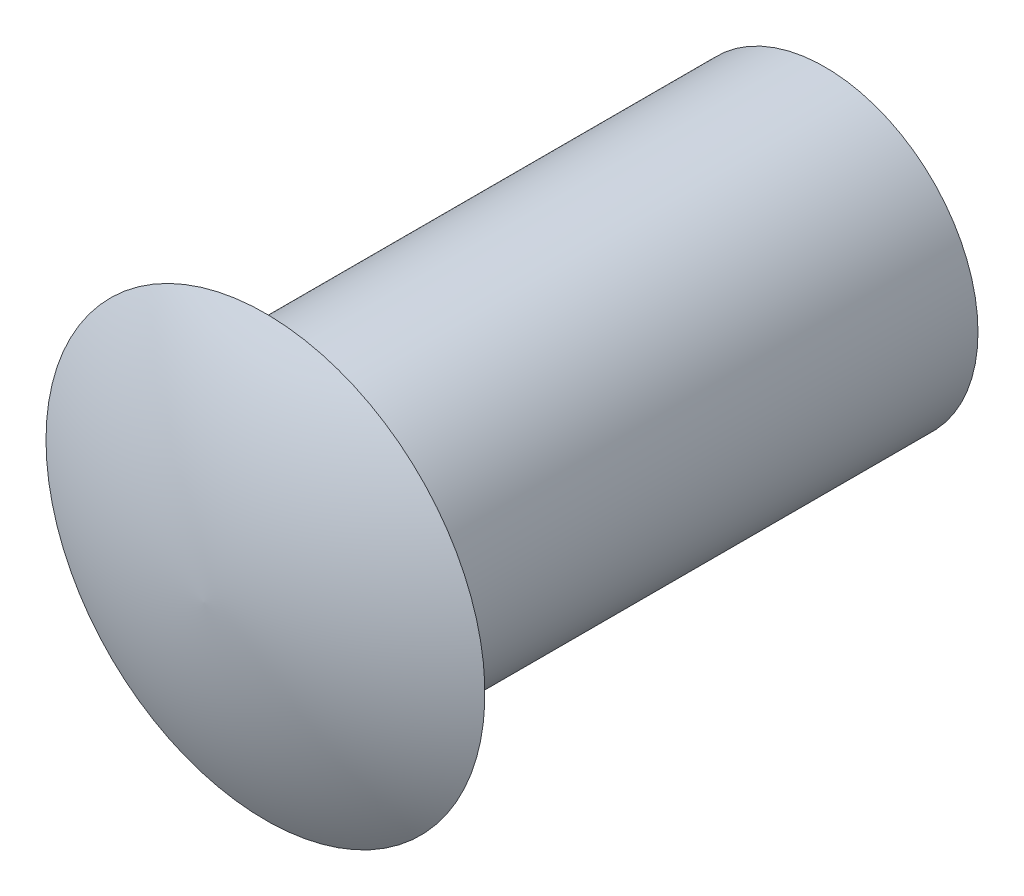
from build123d import *

# Parameters (mm, degrees)
SKETCH1_R           = 1.04267733
BOSS_EXTRUDE1_DEPTH = 3.81


with BuildPart() as part:
    # Sketch1 → Boss-Extrude1 (new body)
    with BuildSketch(Plane.XY):
        Circle(SKETCH1_R)
    extrude(amount=-BOSS_EXTRUDE1_DEPTH)

    # Sketch2 → Revolve4 (revolve)
    with BuildSketch(Plane(origin=(0, 0, 0), x_dir=(1, 0, 0), z_dir=(0, 1, 0))):
        with BuildLine():
            Line((0, 0), (0, -0.419021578))
            ThreePointArc((0, -0.419021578), (0.772600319, -0.299984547), (1.494466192, 0))
            Line((1.494466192, 0), (0, 0))
        make_face()
    revolve(axis=Axis((0, 0, 0), (0, 0, 1)))


solid = part.part
